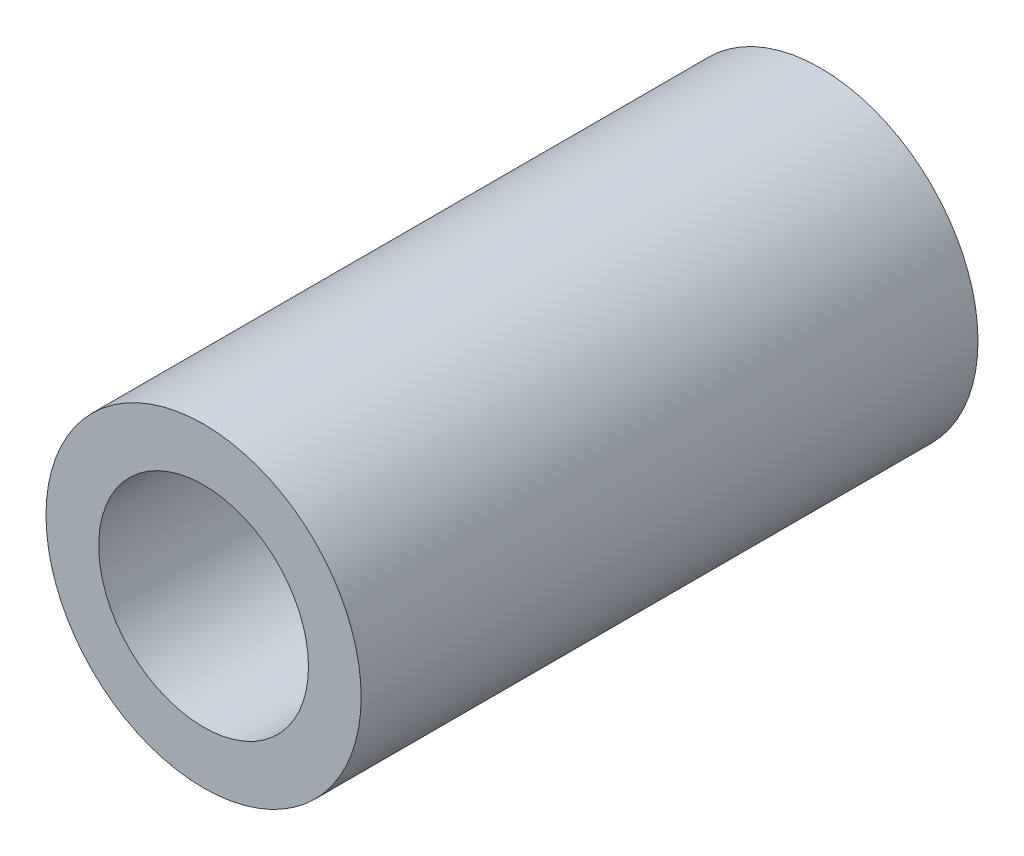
from build123d import *

# Parameters (mm, degrees)
SKETCH2_R          = 4.46405
SKETCH2_R_2        = 2.9718
BASE_EXTRUDE_DEPTH = 8.7376


with BuildPart() as part:
    # Sketch2 → Base-Extrude (new, symmetric)
    with BuildSketch(Plane.XY):
        Circle(SKETCH2_R)
        Circle(SKETCH2_R_2, mode=Mode.SUBTRACT)
    extrude(amount=BASE_EXTRUDE_DEPTH, both=True)


solid = part.part
